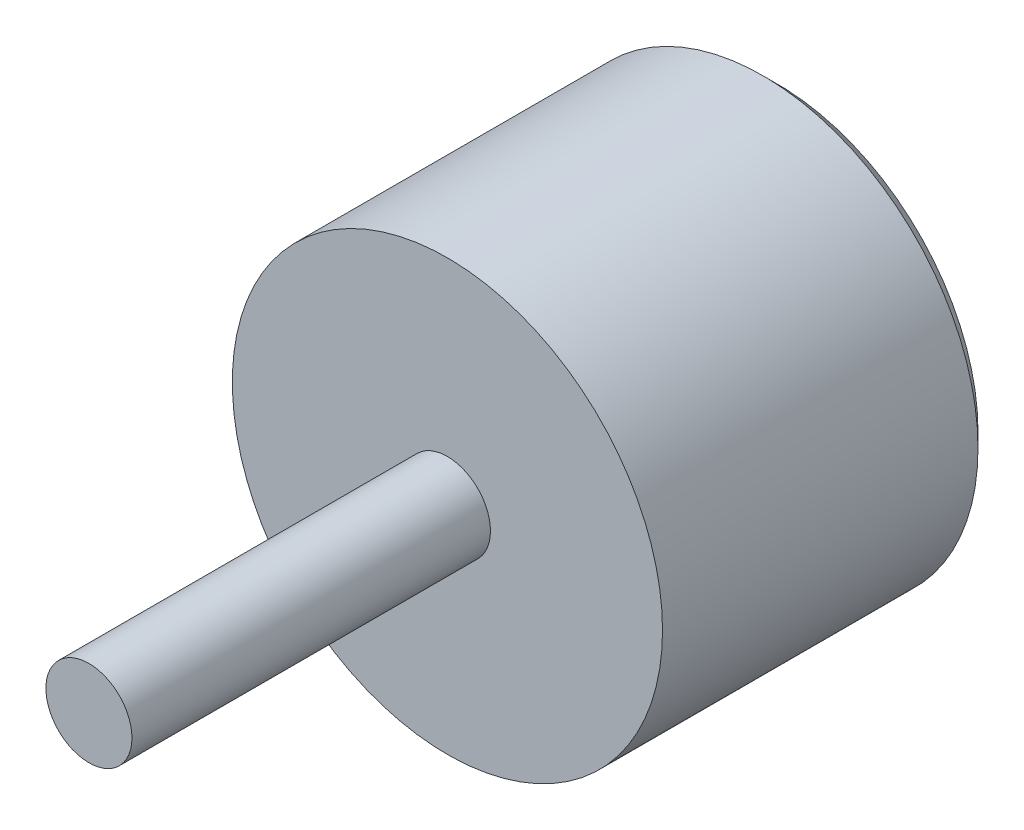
from build123d import *

# Parameters (mm, degrees)
ESQUISSE1_R             = 30
EXTRUSION1_DEPTH        = 46
ESQUISSE2_R             = 6
EXTRUSION2_DEPTH        = 50
ESQUISSE3_R             = 17.5
ENL_V_MAT_EXTRU_1_DEPTH = 30
CHANFREIN1_SIZE         = 2


with BuildPart() as part:
    # Esquisse1 → Extrusion1 (new body)
    with BuildSketch(Plane.XY):
        Circle(ESQUISSE1_R)
    extrude(amount=EXTRUSION1_DEPTH)

    # Esquisse2 → Extrusion2 (add)
    with BuildSketch(Plane.XY.offset(46)):
        Circle(ESQUISSE2_R)
    extrude(amount=EXTRUSION2_DEPTH)

    # Esquisse3 → Enl_v. mat.-Extru.1 (cut)
    with BuildSketch(Plane(origin=(0, 0, 0), x_dir=(-1, 0, 0), z_dir=(0, 0, -1))):
        Circle(ESQUISSE3_R)
    extrude(amount=-ENL_V_MAT_EXTRU_1_DEPTH, mode=Mode.SUBTRACT)

    # Chanfrein1
    chanfrein1_edges = [part.edges().sort_by_distance(p)[0] for p in [
        (-30, 0, 0),
    ]]
    chamfer(chanfrein1_edges, length=CHANFREIN1_SIZE)


solid = part.part
